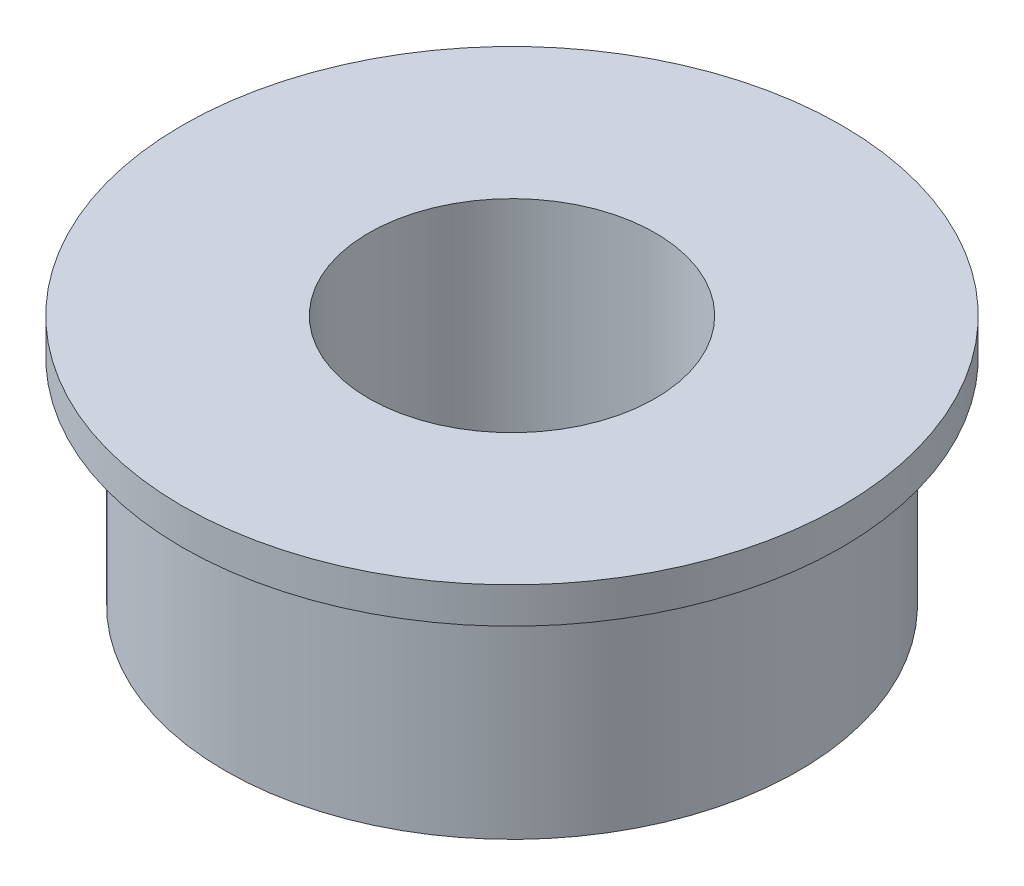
ISO-10303-21;
HEADER;
FILE_DESCRIPTION(('STEP AP214'),'2;1');
FILE_NAME('part.step','',(''),(''),'','','');
FILE_SCHEMA(('AUTOMOTIVE_DESIGN { 1 0 10303 214 1 1 1 1 }'));
ENDSEC;
DATA;
#1=APPLICATION_CONTEXT('core data for automotive mechanical design processes');
#2=APPLICATION_PROTOCOL_DEFINITION('international standard','automotive_design',2000,#1);
#3=PRODUCT_CONTEXT('',#1,'mechanical');
#4=PRODUCT('Part','Part','',(#3));
#5=PRODUCT_RELATED_PRODUCT_CATEGORY('part','',(#4));
#6=PRODUCT_DEFINITION_FORMATION('','',#4);
#7=PRODUCT_DEFINITION_CONTEXT('part definition',#1,'design');
#8=PRODUCT_DEFINITION('design','',#6,#7);
#9=PRODUCT_DEFINITION_SHAPE('','',#8);
#10=(LENGTH_UNIT() NAMED_UNIT(*) SI_UNIT(.MILLI.,.METRE.));
#11=(NAMED_UNIT(*) PLANE_ANGLE_UNIT() SI_UNIT($,.RADIAN.));
#12=(NAMED_UNIT(*) SI_UNIT($,.STERADIAN.) SOLID_ANGLE_UNIT());
#13=UNCERTAINTY_MEASURE_WITH_UNIT(LENGTH_MEASURE(1.E-05),#10,'distance_accuracy_value','');
#14=(GEOMETRIC_REPRESENTATION_CONTEXT(3) GLOBAL_UNCERTAINTY_ASSIGNED_CONTEXT((#13)) GLOBAL_UNIT_ASSIGNED_CONTEXT((#10,
#11,#12)) REPRESENTATION_CONTEXT('',''));
#15=CARTESIAN_POINT('',(0.,0.,0.));
#16=DIRECTION('',(0.,0.,1.));
#17=DIRECTION('',(1.,0.,0.));
#18=AXIS2_PLACEMENT_3D('',#15,#16,#17);
#19=CARTESIAN_POINT('',(0.,0.,0.));
#20=DIRECTION('',(0.,1.,0.));
#21=DIRECTION('',(0.,0.,1.));
#22=AXIS2_PLACEMENT_3D('',#19,#20,#21);
#23=PLANE('',#22);
#24=CARTESIAN_POINT('',(0.,0.,0.));
#25=DIRECTION('',(0.,1.,0.));
#26=DIRECTION('',(0.,0.,1.));
#27=AXIS2_PLACEMENT_3D('',#24,#25,#26);
#28=CIRCLE('',#27,4.);
#29=CARTESIAN_POINT('',(0.,0.,4.));
#30=VERTEX_POINT('',#29);
#31=EDGE_CURVE('E43',#30,#30,#28,.T.);
#32=ORIENTED_EDGE('',*,*,#31,.F.);
#33=EDGE_LOOP('',(#32));
#34=FACE_BOUND('',#33,.T.);
#35=CARTESIAN_POINT('',(0.,0.,0.));
#36=DIRECTION('',(0.,1.,0.));
#37=DIRECTION('',(0.,0.,1.));
#38=AXIS2_PLACEMENT_3D('',#35,#36,#37);
#39=CIRCLE('',#38,2.);
#40=CARTESIAN_POINT('',(0.,0.,2.));
#41=VERTEX_POINT('',#40);
#42=EDGE_CURVE('E50',#41,#41,#39,.T.);
#43=ORIENTED_EDGE('',*,*,#42,.T.);
#44=EDGE_LOOP('',(#43));
#45=FACE_BOUND('',#44,.T.);
#46=ADVANCED_FACE('F39',(#34,#45),#23,.F.);
#47=CARTESIAN_POINT('',(0.,3.,0.));
#48=DIRECTION('',(0.,-1.,0.));
#49=DIRECTION('',(0.,0.,-1.));
#50=AXIS2_PLACEMENT_3D('',#47,#48,#49);
#51=CYLINDRICAL_SURFACE('',#50,4.);
#52=CARTESIAN_POINT('',(0.,3.,0.));
#53=DIRECTION('',(0.,1.,0.));
#54=DIRECTION('',(0.,0.,1.));
#55=AXIS2_PLACEMENT_3D('',#52,#53,#54);
#56=CIRCLE('',#55,4.);
#57=CARTESIAN_POINT('',(0.,3.,4.));
#58=VERTEX_POINT('',#57);
#59=EDGE_CURVE('E10',#58,#58,#56,.T.);
#60=ORIENTED_EDGE('',*,*,#59,.F.);
#61=EDGE_LOOP('',(#60));
#62=FACE_BOUND('',#61,.T.);
#63=ORIENTED_EDGE('',*,*,#31,.T.);
#64=EDGE_LOOP('',(#63));
#65=FACE_BOUND('',#64,.T.);
#66=ADVANCED_FACE('F41',(#62,#65),#51,.T.);
#67=CARTESIAN_POINT('',(0.,3.,0.));
#68=DIRECTION('',(0.,-1.,0.));
#69=DIRECTION('',(0.,0.,-1.));
#70=AXIS2_PLACEMENT_3D('',#67,#68,#69);
#71=CYLINDRICAL_SURFACE('',#70,2.);
#72=ORIENTED_EDGE('',*,*,#42,.F.);
#73=EDGE_LOOP('',(#72));
#74=FACE_BOUND('',#73,.T.);
#75=CARTESIAN_POINT('',(0.,3.5,0.));
#76=DIRECTION('',(0.,1.,0.));
#77=DIRECTION('',(0.,0.,1.));
#78=AXIS2_PLACEMENT_3D('',#75,#76,#77);
#79=CIRCLE('',#78,2.);
#80=CARTESIAN_POINT('',(0.,3.5,2.));
#81=VERTEX_POINT('',#80);
#82=EDGE_CURVE('E58',#81,#81,#79,.T.);
#83=ORIENTED_EDGE('',*,*,#82,.T.);
#84=EDGE_LOOP('',(#83));
#85=FACE_BOUND('',#84,.T.);
#86=ADVANCED_FACE('F64',(#74,#85),#71,.F.);
#87=CARTESIAN_POINT('',(0.,3.5,0.));
#88=DIRECTION('',(0.,1.,0.));
#89=DIRECTION('',(0.,0.,1.));
#90=AXIS2_PLACEMENT_3D('',#87,#88,#89);
#91=PLANE('',#90);
#92=CARTESIAN_POINT('',(0.,3.5,0.));
#93=DIRECTION('',(0.,1.,0.));
#94=DIRECTION('',(0.,0.,1.));
#95=AXIS2_PLACEMENT_3D('',#92,#93,#94);
#96=CIRCLE('',#95,4.6);
#97=CARTESIAN_POINT('',(0.,3.5,4.6));
#98=VERTEX_POINT('',#97);
#99=EDGE_CURVE('E54',#98,#98,#96,.T.);
#100=ORIENTED_EDGE('',*,*,#99,.T.);
#101=EDGE_LOOP('',(#100));
#102=FACE_BOUND('',#101,.T.);
#103=ORIENTED_EDGE('',*,*,#82,.F.);
#104=EDGE_LOOP('',(#103));
#105=FACE_BOUND('',#104,.T.);
#106=ADVANCED_FACE('F66',(#102,#105),#91,.T.);
#107=CARTESIAN_POINT('',(0.,3.,0.));
#108=DIRECTION('',(0.,1.,0.));
#109=DIRECTION('',(0.,0.,1.));
#110=AXIS2_PLACEMENT_3D('',#107,#108,#109);
#111=PLANE('',#110);
#112=ORIENTED_EDGE('',*,*,#59,.T.);
#113=EDGE_LOOP('',(#112));
#114=FACE_BOUND('',#113,.T.);
#115=CARTESIAN_POINT('',(0.,3.,0.));
#116=DIRECTION('',(0.,1.,0.));
#117=DIRECTION('',(0.,0.,1.));
#118=AXIS2_PLACEMENT_3D('',#115,#116,#117);
#119=CIRCLE('',#118,4.6);
#120=CARTESIAN_POINT('',(0.,3.,4.6));
#121=VERTEX_POINT('',#120);
#122=EDGE_CURVE('E55',#121,#121,#119,.T.);
#123=ORIENTED_EDGE('',*,*,#122,.F.);
#124=EDGE_LOOP('',(#123));
#125=FACE_BOUND('',#124,.T.);
#126=ADVANCED_FACE('F68',(#114,#125),#111,.F.);
#127=CARTESIAN_POINT('',(0.,3.5,0.));
#128=DIRECTION('',(0.,-1.,0.));
#129=DIRECTION('',(0.,0.,-1.));
#130=AXIS2_PLACEMENT_3D('',#127,#128,#129);
#131=CYLINDRICAL_SURFACE('',#130,4.6);
#132=ORIENTED_EDGE('',*,*,#99,.F.);
#133=EDGE_LOOP('',(#132));
#134=FACE_BOUND('',#133,.T.);
#135=ORIENTED_EDGE('',*,*,#122,.T.);
#136=EDGE_LOOP('',(#135));
#137=FACE_BOUND('',#136,.T.);
#138=ADVANCED_FACE('F75',(#134,#137),#131,.T.);
#139=CLOSED_SHELL('',(#46,#66,#86,#106,#126,#138));
#140=MANIFOLD_SOLID_BREP('B2',#139);
#141=ADVANCED_BREP_SHAPE_REPRESENTATION('',(#18,#140),#14);
#142=SHAPE_DEFINITION_REPRESENTATION(#9,#141);
ENDSEC;
END-ISO-10303-21;
